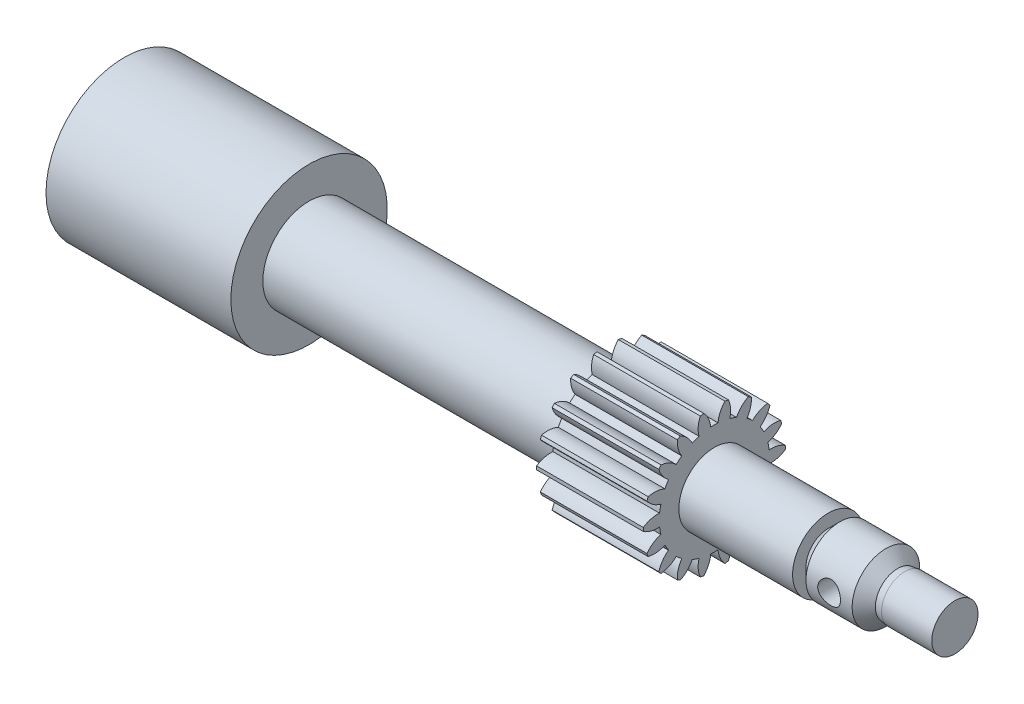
from build123d import *

# Parameters (mm, degrees)
BASPROSKE_W        = 15
BASPROSKE_H        = 10
TOOTHCUT_DEPTH     = 21.615528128
TEETHCUTS_COUNT    = 18
TEETHCUTS_ANGLE    = 340
BORSKE_R           = 1
BORE_DEPTH         = 50.0000508
SKETCH4_R          = 1.6
CUT_EXTRUDE2_DEPTH = 71.661605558


with BuildPart() as part:
    # BasProSke → Base-Revolve (revolve)
    with BuildSketch(Plane(origin=(0, 0, 0), x_dir=(1, 0, 0), z_dir=(0, 1, 0)), mode=Mode.PRIVATE) as base_revolve_sk:
        with Locations((7.5, 5)):
            Rectangle(BASPROSKE_W, BASPROSKE_H)
    revolve(base_revolve_sk.sketch.rotate(Axis((-10, 0, 0), (1, 0, 0)), 180), axis=Axis((-10, 0, 0), (1, 0, 0)))

    # TooCutSke → ToothCut (cut, through all)
    with BuildSketch(Plane(origin=(0, 0, 0), x_dir=(0, 0, -1), z_dir=(1, 0, 0))):
        with BuildLine():
            ThreePointArc((0.510641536, 7.732156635), (0, 7.749), (-0.510641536, 7.732156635))
            ThreePointArc((-0.510641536, 7.732156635), (-0.82619259, 8.907320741), (-1.515208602, 9.910236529))
            ThreePointArc((-1.515208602, 9.910236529), (0, 10.0254), (1.515208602, 9.910236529))
            ThreePointArc((1.515208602, 9.910236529), (0.82619259, 8.907320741), (0.510641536, 7.732156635))
        make_face()
    toothcut = extrude(amount=TOOTHCUT_DEPTH, mode=Mode.SUBTRACT)

    # TeethCuts: ToothCut ×18 about axis
    teethcuts_axis = Axis((-10, 0, 0), (1, 0, 0))
    for i in range(1, TEETHCUTS_COUNT):
        add(toothcut.rotate(teethcuts_axis, i * TEETHCUTS_ANGLE / (TEETHCUTS_COUNT - 1)), mode=Mode.SUBTRACT)

    # BorSke → Bore (cut, symmetric)
    with BuildSketch(Plane(origin=(0, 0, 0), x_dir=(0, 0, -1), z_dir=(1, 0, 0))):
        with Locations(Location((0, 0, 0), (0, 0, 180))):
            Circle(BORSKE_R)
    extrude(amount=BORE_DEPTH, both=True, mode=Mode.SUBTRACT)

    # Sketch1 → Revolve1 (revolve)
    with BuildSketch(Plane(origin=(0, 0, 0), x_dir=(1, 0, 0), z_dir=(0, 1, 0)), mode=Mode.PRIVATE) as revolve1_sk:
        Polygon((-68, 0), (-68, 11), (-42, 11), (-42, 6.5), (0, 6.5), (0, 0), align=None)
    revolve(revolve1_sk.sketch.rotate(Axis((-68, 0, 0), (1, 0, 0)), 180), axis=Axis((-68, 0, 0), (1, 0, 0)))


with BuildPart() as body_2:
    # Sketch2 → Revolve2 (revolve)
    with BuildSketch(Plane(origin=(0, 0, 0), x_dir=(1, 0, 0), z_dir=(0, 1, 0))):
        Polygon((15, 0), (15, 5), (31, 5), (31, 3.12), (32.63, 4.75), (39.13, 4.75), (40.76, 3.12), (41.76, 3.25), (48.826954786, 3.25), (48.826954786, 0), align=None)
    revolve(axis=Axis((48.826954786, 0, 0), (-1, 0, 0)))

    # Sketch4 → Cut-Extrude2 (cut, through all)
    with BuildSketch(Plane(origin=(0, 0, -4.75), x_dir=(-1, 0, 0), z_dir=(0, 0, -1))):
        with Locations((-35.88, 0)):
            Circle(SKETCH4_R)
    extrude(amount=-CUT_EXTRUDE2_DEPTH, mode=Mode.SUBTRACT)


solid = Compound([part.part, body_2.part])
